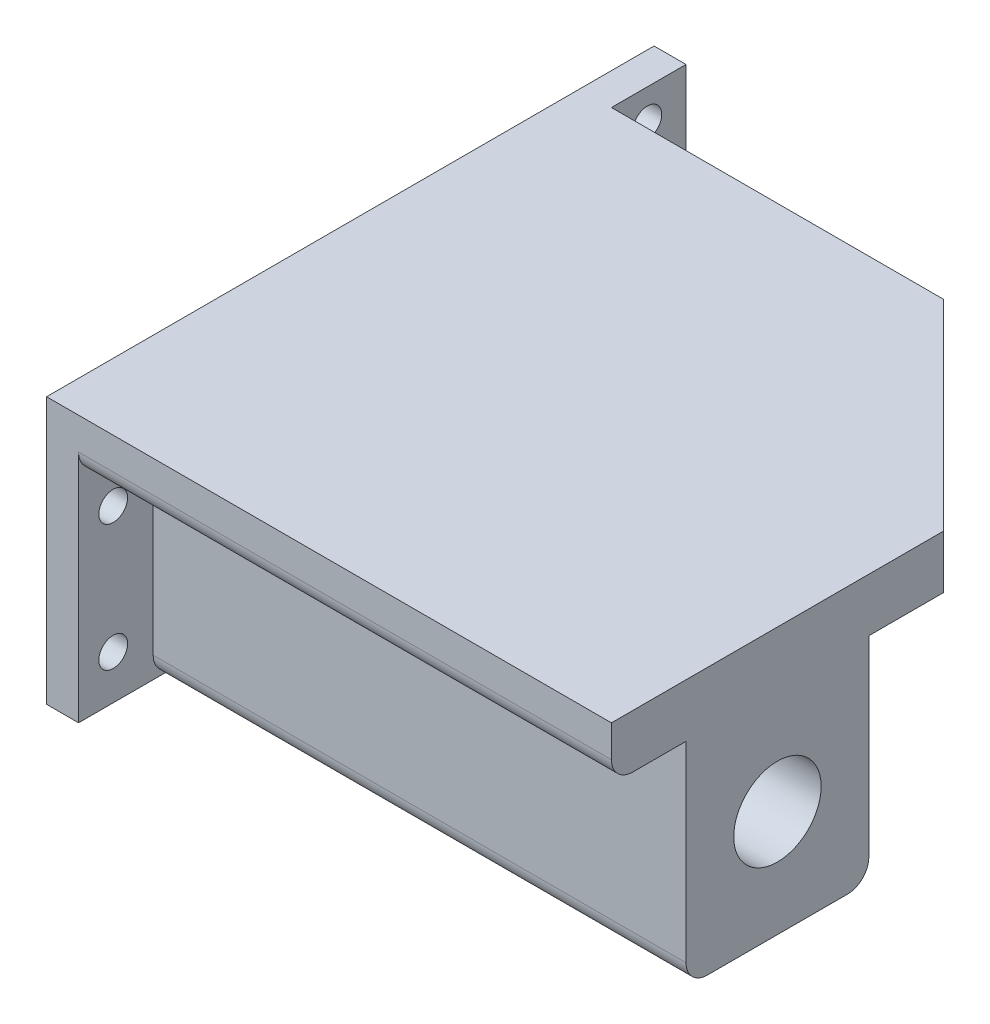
from build123d import *

# Parameters (mm, degrees)
BOSS_EXTRUDE1_DEPTH     = 5
SKETCH2_W               = 50
SKETCH2_H               = 17.15
BOSS_EXTRUDE2_DEPTH     = 20
SKETCH3_R               = 4.1
CUT_EXTRUDE1_DEPTH      = 30
FILLET1_R               = 2
SKETCH8_W               = 57
SKETCH8_H               = 25
BOSS_EXTRUDE5_DEPTH     = 3
CUT_EXTRUDE2_DEPTH      = 63.327903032
CUT_EXTRUDE2_DEPTH_BACK = 63.327903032
SKETCH9_R               = 1.35


with BuildPart() as part:
    # Sketch1 → Boss-Extrude1 (new body)
    with BuildSketch(Plane(origin=(0, 0, 0), x_dir=(1, 0, 0), z_dir=(0, 1, 0))):
        Polygon((5.529592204, -25.618994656), (24.381005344, -25.618994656), (24.381005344, -6.767581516), (24.381005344, 5.531005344), (5.531005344, 24.381005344), (-25.618994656, 24.381005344), (-25.618994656, -25.618994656), align=None)
    extrude(amount=BOSS_EXTRUDE1_DEPTH)

    # Sketch2 → Boss-Extrude2 (add)
    with BuildSketch(Plane.XZ):
        with Locations((-0.618994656, 10.043994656)):
            Rectangle(SKETCH2_W, SKETCH2_H)
    extrude(amount=BOSS_EXTRUDE2_DEPTH)

    # Sketch3 → Cut-Extrude1 (cut)
    with BuildSketch(Plane(origin=(24.381005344, 0, 0), x_dir=(0, 0, -1), z_dir=(1, 0, 0))):
        with Locations((-10.043994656, -10)):
            Circle(SKETCH3_R)
    extrude(amount=-CUT_EXTRUDE1_DEPTH, mode=Mode.SUBTRACT)

    # Fillet1
    fillet1_edges = [part.edges().sort_by_distance(p)[0] for p in [
        (-0.618994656, -20, 18.618994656),
        (-0.618994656, -20, 1.468994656),
        (-10.043994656, 0, -24.381005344),
        (-0.618994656, 0, 25.618994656),
    ]]
    fillet(fillet1_edges, radius=FILLET1_R)

    # Sketch8 → Boss-Extrude5 (add)
    with BuildSketch(Plane.ZY.offset(25.618994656)):
        with Locations((-2.881005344, -7.5)):
            Rectangle(SKETCH8_W, SKETCH8_H)
    extrude(amount=BOSS_EXTRUDE5_DEPTH)

    # Sketch9 → Cut-Extrude2 (cut, two sides: drawn at the far end of the back side and taken through both)
    with BuildSketch(Plane(origin=(-25.618994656, 0, 0), x_dir=(0, 0, -1), z_dir=(1, 0, 0)).offset(-CUT_EXTRUDE2_DEPTH_BACK)):
        with Locations((27.752661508, 2.091741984)):
            Circle(SKETCH9_R)
        with Locations((27.752661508, -15.858034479)):
            Circle(SKETCH9_R)
        with Locations((-22.368199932, -15.858034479)):
            Circle(SKETCH9_R)
        with Locations((-22.368199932, -3.996043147)):
            Circle(SKETCH9_R)
    extrude(amount=CUT_EXTRUDE2_DEPTH + CUT_EXTRUDE2_DEPTH_BACK, mode=Mode.SUBTRACT)


solid = part.part
